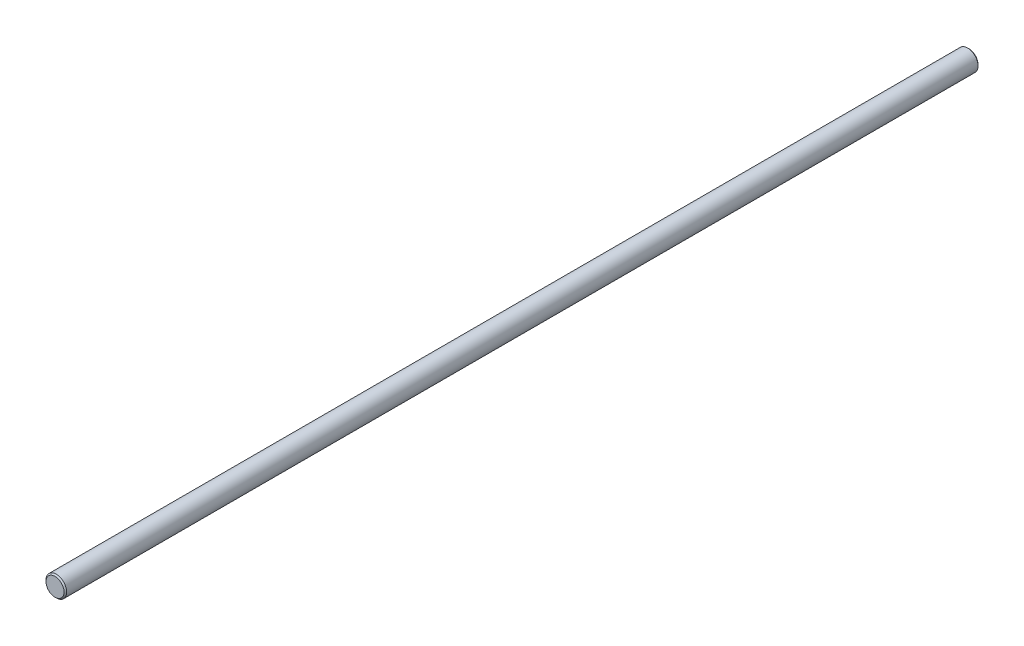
from build123d import *

# Parameters (mm, degrees)
SKETCH_1_W     = 4
SKETCH_1_H     = 354
CHAMFER_1_SIZE = 0.5


with BuildPart() as part:
    # Sketch 1 → Revolve 1 (revolve)
    with BuildSketch(Plane(origin=(0, 0, 0), x_dir=(1, 0, 0), z_dir=(0, 1, 0))):
        with Locations((2, 0)):
            Rectangle(SKETCH_1_W, SKETCH_1_H)
    revolve(axis=Axis((0, 0, -177), (0, 0, 1)))

    # Chamfer 1
    chamfer_1_edges = [part.edges().sort_by_distance(p)[0] for p in [
        (-4, 0, -177),
        (-4, 0, 177),
    ]]
    chamfer(chamfer_1_edges, length=CHAMFER_1_SIZE)


solid = part.part
